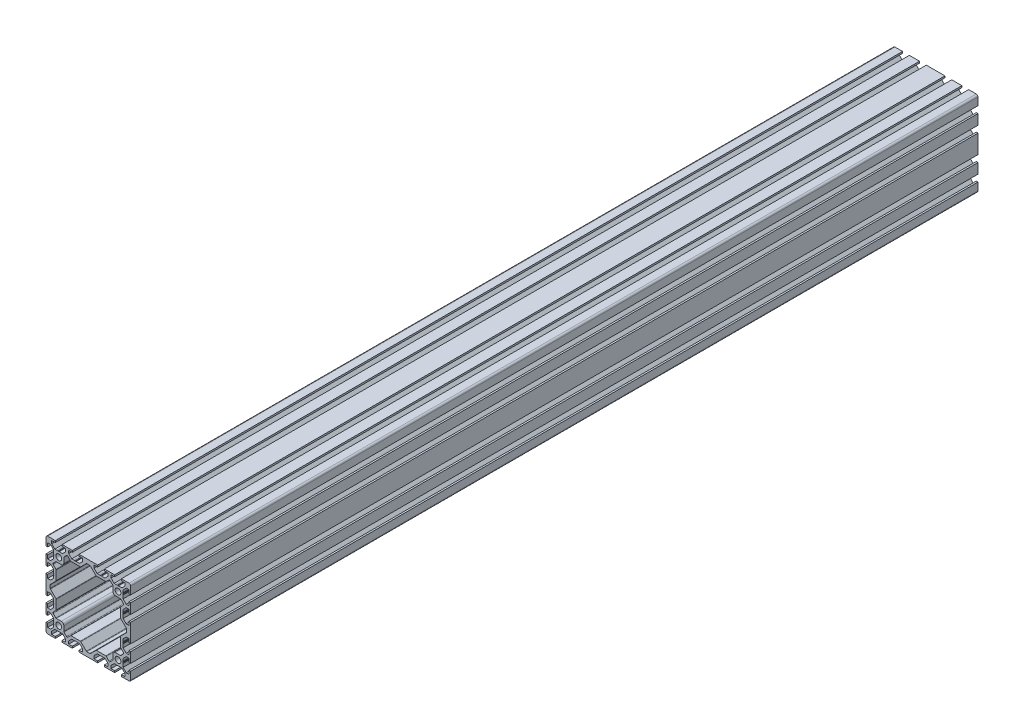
from build123d import *

# Parameters (mm, degrees)
MODEL_R            = 3.4
BOSS_EXTRU_1_DEPTH = 1000


with BuildPart() as part:
    # Model → Boss.-Extru.1 (new body)
    with BuildSketch(Plane.XY):
        with BuildLine():
            Line((-50, 11), (-50, -11))
            Line((-50, -11), (-48, -11))
            Line((-48, -11), (-48, -6.75))
            Line((-48, -6.75), (-44.664213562, -6.75))
            Line((-44.664213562, -6.75), (-41, -10.414213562))
            Line((-41, -10.414213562), (-41, -14.346410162))
            ThreePointArc((-41, -14.346410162), (-40.982962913, -14.475819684), (-40.933012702, -14.596410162))
            Line((-40.933012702, -14.596410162), (-40.7, -15))
            Line((-40.7, -15), (-40.933012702, -15.403589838))
            ThreePointArc((-40.933012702, -15.403589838), (-41, -15.653589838), (-40.933012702, -15.903589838))
            Line((-40.933012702, -15.903589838), (-40.750976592, -16.218885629))
            Line((-40.750976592, -16.218885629), (-41, -17.5))
            Line((-41, -17.5), (-41, -19.585786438))
            Line((-41, -19.585786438), (-44.664213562, -23.25))
            Line((-44.664213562, -23.25), (-48, -23.25))
            Line((-48, -23.25), (-48, -19))
            Line((-48, -19), (-50, -19))
            Line((-50, -19), (-50, -31))
            Line((-50, -31), (-48, -31))
            Line((-48, -31), (-48, -26.75))
            Line((-48, -26.75), (-44.664213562, -26.75))
            Line((-44.664213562, -26.75), (-41, -30.414213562))
            Line((-41, -30.414213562), (-41, -34.346410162))
            ThreePointArc((-41, -34.346410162), (-40.982962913, -34.475819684), (-40.933012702, -34.596410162))
            Line((-40.933012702, -34.596410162), (-40.7, -35))
            Line((-40.7, -35), (-40.933012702, -35.403589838))
            ThreePointArc((-40.933012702, -35.403589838), (-41, -35.653589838), (-40.933012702, -35.903589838))
            Line((-40.933012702, -35.903589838), (-40.750976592, -36.218885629))
            Line((-40.750976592, -36.218885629), (-41, -37.5))
            Line((-41, -37.5), (-41, -39.585786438))
            Line((-41, -39.585786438), (-44.664213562, -43.25))
            Line((-44.664213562, -43.25), (-48, -43.25))
            Line((-48, -43.25), (-48, -39))
            Line((-48, -39), (-50, -39))
            Line((-50, -39), (-50, -48))
            ThreePointArc((-50, -48), (-49.414213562, -49.414213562), (-48, -50))
            Line((-48, -50), (-39, -50))
            Line((-39, -50), (-39, -48))
            Line((-39, -48), (-43.25, -48))
            Line((-43.25, -48), (-43.25, -44.664213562))
            Line((-43.25, -44.664213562), (-39.585786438, -41))
            Line((-39.585786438, -41), (-35.653589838, -41))
            ThreePointArc((-35.653589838, -41), (-35.524180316, -40.982962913), (-35.403589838, -40.933012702))
            Line((-35.403589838, -40.933012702), (-35, -40.7))
            Line((-35, -40.7), (-34.596410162, -40.933012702))
            ThreePointArc((-34.596410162, -40.933012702), (-34.346410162, -41), (-34.096410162, -40.933012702))
            Line((-34.096410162, -40.933012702), (-33.781114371, -40.750976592))
            Line((-33.781114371, -40.750976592), (-32.5, -41))
            Line((-32.5, -41), (-30.414213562, -41))
            Line((-30.414213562, -41), (-26.75, -44.664213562))
            Line((-26.75, -44.664213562), (-26.75, -48))
            Line((-26.75, -48), (-31, -48))
            Line((-31, -48), (-31, -50))
            Line((-31, -50), (-19, -50))
            Line((-19, -50), (-19, -48))
            Line((-19, -48), (-23.25, -48))
            Line((-23.25, -48), (-23.25, -44.664213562))
            Line((-23.25, -44.664213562), (-19.585786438, -41))
            Line((-19.585786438, -41), (-15.653589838, -41))
            ThreePointArc((-15.653589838, -41), (-15.524180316, -40.982962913), (-15.403589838, -40.933012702))
            Line((-15.403589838, -40.933012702), (-15, -40.7))
            Line((-15, -40.7), (-14.596410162, -40.933012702))
            ThreePointArc((-14.596410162, -40.933012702), (-14.346410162, -41), (-14.096410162, -40.933012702))
            Line((-14.096410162, -40.933012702), (-13.781114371, -40.750976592))
            Line((-13.781114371, -40.750976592), (-12.5, -41))
            Line((-12.5, -41), (-10.414213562, -41))
            Line((-10.414213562, -41), (-6.75, -44.664213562))
            Line((-6.75, -44.664213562), (-6.75, -48))
            Line((-6.75, -48), (-11, -48))
            Line((-11, -48), (-11, -50))
            Line((-11, -50), (11, -50))
            Line((11, -50), (11, -48))
            Line((11, -48), (6.75, -48))
            Line((6.75, -48), (6.75, -44.664213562))
            Line((6.75, -44.664213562), (10.414213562, -41))
            Line((10.414213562, -41), (14.346410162, -41))
            ThreePointArc((14.346410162, -41), (14.475819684, -40.982962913), (14.596410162, -40.933012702))
            Line((14.596410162, -40.933012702), (15, -40.7))
            Line((15, -40.7), (15.403589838, -40.933012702))
            ThreePointArc((15.403589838, -40.933012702), (15.653589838, -41), (15.903589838, -40.933012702))
            Line((15.903589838, -40.933012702), (16.218885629, -40.750976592))
            Line((16.218885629, -40.750976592), (17.5, -41))
            Line((17.5, -41), (19.585786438, -41))
            Line((19.585786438, -41), (23.25, -44.664213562))
            Line((23.25, -44.664213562), (23.25, -48))
            Line((23.25, -48), (19, -48))
            Line((19, -48), (19, -50))
            Line((19, -50), (31, -50))
            Line((31, -50), (31, -48))
            Line((31, -48), (26.75, -48))
            Line((26.75, -48), (26.75, -44.664213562))
            Line((26.75, -44.664213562), (30.414213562, -41))
            Line((30.414213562, -41), (34.346410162, -41))
            ThreePointArc((34.346410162, -41), (34.475819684, -40.982962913), (34.596410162, -40.933012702))
            Line((34.596410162, -40.933012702), (35, -40.7))
            Line((35, -40.7), (35.403589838, -40.933012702))
            ThreePointArc((35.403589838, -40.933012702), (35.653589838, -41), (35.903589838, -40.933012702))
            Line((35.903589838, -40.933012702), (36.218885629, -40.750976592))
            Line((36.218885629, -40.750976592), (37.5, -41))
            Line((37.5, -41), (39.585786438, -41))
            Line((39.585786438, -41), (43.25, -44.664213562))
            Line((43.25, -44.664213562), (43.25, -48))
            Line((43.25, -48), (39, -48))
            Line((39, -48), (39, -50))
            Line((39, -50), (48, -50))
            ThreePointArc((48, -50), (49.414213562, -49.414213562), (50, -48))
            Line((50, -48), (50, -39))
            Line((50, -39), (48, -39))
            Line((48, -39), (48, -43.25))
            Line((48, -43.25), (44.664213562, -43.25))
            Line((44.664213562, -43.25), (41, -39.585786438))
            Line((41, -39.585786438), (41, -35.653589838))
            ThreePointArc((41, -35.653589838), (40.982962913, -35.524180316), (40.933012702, -35.403589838))
            Line((40.933012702, -35.403589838), (40.7, -35))
            Line((40.7, -35), (40.933012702, -34.596410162))
            ThreePointArc((40.933012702, -34.596410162), (41, -34.346410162), (40.933012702, -34.096410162))
            Line((40.933012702, -34.096410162), (40.750976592, -33.781114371))
            Line((40.750976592, -33.781114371), (41, -32.5))
            Line((41, -32.5), (41, -30.414213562))
            Line((41, -30.414213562), (44.664213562, -26.75))
            Line((44.664213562, -26.75), (48, -26.75))
            Line((48, -26.75), (48, -31))
            Line((48, -31), (50, -31))
            Line((50, -31), (50, -19))
            Line((50, -19), (48, -19))
            Line((48, -19), (48, -23.25))
            Line((48, -23.25), (44.664213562, -23.25))
            Line((44.664213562, -23.25), (41, -19.585786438))
            Line((41, -19.585786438), (41, -15.653589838))
            ThreePointArc((41, -15.653589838), (40.982962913, -15.524180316), (40.933012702, -15.403589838))
            Line((40.933012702, -15.403589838), (40.7, -15))
            Line((40.7, -15), (40.933012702, -14.596410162))
            ThreePointArc((40.933012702, -14.596410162), (41, -14.346410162), (40.933012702, -14.096410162))
            Line((40.933012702, -14.096410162), (40.750976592, -13.781114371))
            Line((40.750976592, -13.781114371), (41, -12.5))
            Line((41, -12.5), (41, -10.414213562))
            Line((41, -10.414213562), (44.664213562, -6.75))
            Line((44.664213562, -6.75), (48, -6.75))
            Line((48, -6.75), (48, -11))
            Line((48, -11), (50, -11))
            Line((50, -11), (50, 11))
            Line((50, 11), (48, 11))
            Line((48, 11), (48, 6.75))
            Line((48, 6.75), (44.664213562, 6.75))
            Line((44.664213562, 6.75), (41, 10.414213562))
            Line((41, 10.414213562), (41, 14.346410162))
            ThreePointArc((41, 14.346410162), (40.982962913, 14.475819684), (40.933012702, 14.596410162))
            Line((40.933012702, 14.596410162), (40.7, 15))
            Line((40.7, 15), (40.933012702, 15.403589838))
            ThreePointArc((40.933012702, 15.403589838), (41, 15.653589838), (40.933012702, 15.903589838))
            Line((40.933012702, 15.903589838), (40.750976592, 16.218885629))
            Line((40.750976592, 16.218885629), (41, 17.5))
            Line((41, 17.5), (41, 19.585786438))
            Line((41, 19.585786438), (44.664213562, 23.25))
            Line((44.664213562, 23.25), (48, 23.25))
            Line((48, 23.25), (48, 19))
            Line((48, 19), (50, 19))
            Line((50, 19), (50, 31))
            Line((50, 31), (48, 31))
            Line((48, 31), (48, 26.75))
            Line((48, 26.75), (44.664213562, 26.75))
            Line((44.664213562, 26.75), (41, 30.414213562))
            Line((41, 30.414213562), (41, 34.346410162))
            ThreePointArc((41, 34.346410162), (40.982962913, 34.475819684), (40.933012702, 34.596410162))
            Line((40.933012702, 34.596410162), (40.7, 35))
            Line((40.7, 35), (40.933012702, 35.403589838))
            ThreePointArc((40.933012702, 35.403589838), (41, 35.653589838), (40.933012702, 35.903589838))
            Line((40.933012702, 35.903589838), (40.750976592, 36.218885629))
            Line((40.750976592, 36.218885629), (41, 37.5))
            Line((41, 37.5), (41, 39.585786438))
            Line((41, 39.585786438), (44.664213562, 43.25))
            Line((44.664213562, 43.25), (48, 43.25))
            Line((48, 43.25), (48, 39))
            Line((48, 39), (50, 39))
            Line((50, 39), (50, 48))
            ThreePointArc((50, 48), (49.414213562, 49.414213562), (48, 50))
            Line((48, 50), (39, 50))
            Line((39, 50), (39, 48))
            Line((39, 48), (43.25, 48))
            Line((43.25, 48), (43.25, 44.664213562))
            Line((43.25, 44.664213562), (39.585786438, 41))
            Line((39.585786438, 41), (35.653589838, 41))
            ThreePointArc((35.653589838, 41), (35.524180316, 40.982962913), (35.403589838, 40.933012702))
            Line((35.403589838, 40.933012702), (35, 40.7))
            Line((35, 40.7), (34.596410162, 40.933012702))
            ThreePointArc((34.596410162, 40.933012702), (34.346410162, 41), (34.096410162, 40.933012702))
            Line((34.096410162, 40.933012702), (33.781114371, 40.750976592))
            Line((33.781114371, 40.750976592), (32.5, 41))
            Line((32.5, 41), (30.414213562, 41))
            Line((30.414213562, 41), (26.75, 44.664213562))
            Line((26.75, 44.664213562), (26.75, 48))
            Line((26.75, 48), (31, 48))
            Line((31, 48), (31, 50))
            Line((31, 50), (19, 50))
            Line((19, 50), (19, 48))
            Line((19, 48), (23.25, 48))
            Line((23.25, 48), (23.25, 44.664213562))
            Line((23.25, 44.664213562), (19.585786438, 41))
            Line((19.585786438, 41), (15.653589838, 41))
            ThreePointArc((15.653589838, 41), (15.524180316, 40.982962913), (15.403589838, 40.933012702))
            Line((15.403589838, 40.933012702), (15, 40.7))
            Line((15, 40.7), (14.596410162, 40.933012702))
            ThreePointArc((14.596410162, 40.933012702), (14.346410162, 41), (14.096410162, 40.933012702))
            Line((14.096410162, 40.933012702), (13.781114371, 40.750976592))
            Line((13.781114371, 40.750976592), (12.5, 41))
            Line((12.5, 41), (10.414213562, 41))
            Line((10.414213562, 41), (6.75, 44.664213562))
            Line((6.75, 44.664213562), (6.75, 48))
            Line((6.75, 48), (11, 48))
            Line((11, 48), (11, 50))
            Line((11, 50), (-11, 50))
            Line((-11, 50), (-11, 48))
            Line((-11, 48), (-6.75, 48))
            Line((-6.75, 48), (-6.75, 44.664213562))
            Line((-6.75, 44.664213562), (-10.414213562, 41))
            Line((-10.414213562, 41), (-14.346410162, 41))
            ThreePointArc((-14.346410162, 41), (-14.475819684, 40.982962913), (-14.596410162, 40.933012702))
            Line((-14.596410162, 40.933012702), (-15, 40.7))
            Line((-15, 40.7), (-15.403589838, 40.933012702))
            ThreePointArc((-15.403589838, 40.933012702), (-15.653589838, 41), (-15.903589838, 40.933012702))
            Line((-15.903589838, 40.933012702), (-16.218885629, 40.750976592))
            Line((-16.218885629, 40.750976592), (-17.5, 41))
            Line((-17.5, 41), (-19.585786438, 41))
            Line((-19.585786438, 41), (-23.25, 44.664213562))
            Line((-23.25, 44.664213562), (-23.25, 48))
            Line((-23.25, 48), (-19, 48))
            Line((-19, 48), (-19, 50))
            Line((-19, 50), (-31, 50))
            Line((-31, 50), (-31, 48))
            Line((-31, 48), (-26.75, 48))
            Line((-26.75, 48), (-26.75, 44.664213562))
            Line((-26.75, 44.664213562), (-30.414213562, 41))
            Line((-30.414213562, 41), (-34.346410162, 41))
            ThreePointArc((-34.346410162, 41), (-34.475819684, 40.982962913), (-34.596410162, 40.933012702))
            Line((-34.596410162, 40.933012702), (-35, 40.7))
            Line((-35, 40.7), (-35.403589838, 40.933012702))
            ThreePointArc((-35.403589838, 40.933012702), (-35.653589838, 41), (-35.903589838, 40.933012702))
            Line((-35.903589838, 40.933012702), (-36.218885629, 40.750976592))
            Line((-36.218885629, 40.750976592), (-37.5, 41))
            Line((-37.5, 41), (-39.585786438, 41))
            Line((-39.585786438, 41), (-43.25, 44.664213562))
            Line((-43.25, 44.664213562), (-43.25, 48))
            Line((-43.25, 48), (-39, 48))
            Line((-39, 48), (-39, 50))
            Line((-39, 50), (-48, 50))
            ThreePointArc((-48, 50), (-49.414213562, 49.414213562), (-50, 48))
            Line((-50, 48), (-50, 39))
            Line((-50, 39), (-48, 39))
            Line((-48, 39), (-48, 43.25))
            Line((-48, 43.25), (-44.664213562, 43.25))
            Line((-44.664213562, 43.25), (-41, 39.585786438))
            Line((-41, 39.585786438), (-41, 35.653589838))
            ThreePointArc((-41, 35.653589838), (-40.982962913, 35.524180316), (-40.933012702, 35.403589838))
            Line((-40.933012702, 35.403589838), (-40.7, 35))
            Line((-40.7, 35), (-40.933012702, 34.596410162))
            ThreePointArc((-40.933012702, 34.596410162), (-41, 34.346410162), (-40.933012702, 34.096410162))
            Line((-40.933012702, 34.096410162), (-40.750976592, 33.781114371))
            Line((-40.750976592, 33.781114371), (-41, 32.5))
            Line((-41, 32.5), (-41, 30.414213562))
            Line((-41, 30.414213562), (-44.664213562, 26.75))
            Line((-44.664213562, 26.75), (-48, 26.75))
            Line((-48, 26.75), (-48, 31))
            Line((-48, 31), (-50, 31))
            Line((-50, 31), (-50, 19))
            Line((-50, 19), (-48, 19))
            Line((-48, 19), (-48, 23.25))
            Line((-48, 23.25), (-44.664213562, 23.25))
            Line((-44.664213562, 23.25), (-41, 19.585786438))
            Line((-41, 19.585786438), (-41, 15.653589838))
            ThreePointArc((-41, 15.653589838), (-40.982962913, 15.524180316), (-40.933012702, 15.403589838))
            Line((-40.933012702, 15.403589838), (-40.7, 15))
            Line((-40.7, 15), (-40.933012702, 14.596410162))
            ThreePointArc((-40.933012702, 14.596410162), (-41, 14.346410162), (-40.933012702, 14.096410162))
            Line((-40.933012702, 14.096410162), (-40.750976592, 13.781114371))
            Line((-40.750976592, 13.781114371), (-41, 12.5))
            Line((-41, 12.5), (-41, 10.414213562))
            Line((-41, 10.414213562), (-44.664213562, 6.75))
            Line((-44.664213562, 6.75), (-48, 6.75))
            Line((-48, 6.75), (-48, 11))
            Line((-48, 11), (-50, 11))
        make_face()
        with Locations((35, -35)):
            Circle(MODEL_R, mode=Mode.SUBTRACT)
        with Locations((35, 35)):
            Circle(MODEL_R, mode=Mode.SUBTRACT)
        with Locations((-35, 35)):
            Circle(MODEL_R, mode=Mode.SUBTRACT)
        with Locations((-35, -35)):
            Circle(MODEL_R, mode=Mode.SUBTRACT)
        with BuildLine():
            Line((-45, 1.757359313), (-45, -1.757359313))
            ThreePointArc((-45, -1.757359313), (-44.923879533, -2.140042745), (-44.707106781, -2.464466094))
            Line((-44.707106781, -2.464466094), (-38.292893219, -8.878679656))
            ThreePointArc((-38.292893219, -8.878679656), (-38.076120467, -9.203103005), (-38, -9.585786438))
            Line((-38, -9.585786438), (-38, -20.414213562))
            ThreePointArc((-38, -20.414213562), (-38.076120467, -20.796896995), (-38.292893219, -21.121320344))
            Line((-38.292893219, -21.121320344), (-41.464466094, -24.292893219))
            ThreePointArc((-41.464466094, -24.292893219), (-41.757359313, -25), (-41.464466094, -25.707106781))
            Line((-41.464466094, -25.707106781), (-38.464466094, -28.707106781))
            ThreePointArc((-38.464466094, -28.707106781), (-38.140042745, -28.923879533), (-37.757359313, -29))
            Line((-37.757359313, -29), (-32, -29))
            ThreePointArc((-32, -29), (-29.878679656, -29.878679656), (-29, -32))
            Line((-29, -32), (-29, -37.757359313))
            ThreePointArc((-29, -37.757359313), (-28.923879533, -38.140042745), (-28.707106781, -38.464466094))
            Line((-28.707106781, -38.464466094), (-25.707106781, -41.464466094))
            ThreePointArc((-25.707106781, -41.464466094), (-25, -41.757359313), (-24.292893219, -41.464466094))
            Line((-24.292893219, -41.464466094), (-21.121320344, -38.292893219))
            ThreePointArc((-21.121320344, -38.292893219), (-20.796896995, -38.076120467), (-20.414213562, -38))
            Line((-20.414213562, -38), (-9.585786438, -38))
            ThreePointArc((-9.585786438, -38), (-9.203103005, -38.076120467), (-8.878679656, -38.292893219))
            Line((-8.878679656, -38.292893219), (-2.464466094, -44.707106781))
            ThreePointArc((-2.464466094, -44.707106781), (-2.140042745, -44.923879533), (-1.757359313, -45))
            Line((-1.757359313, -45), (1.757359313, -45))
            ThreePointArc((1.757359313, -45), (2.140042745, -44.923879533), (2.464466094, -44.707106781))
            Line((2.464466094, -44.707106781), (8.878679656, -38.292893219))
            ThreePointArc((8.878679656, -38.292893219), (9.203103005, -38.076120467), (9.585786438, -38))
            Line((9.585786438, -38), (20.414213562, -38))
            ThreePointArc((20.414213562, -38), (20.796896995, -38.076120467), (21.121320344, -38.292893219))
            Line((21.121320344, -38.292893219), (24.292893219, -41.464466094))
            ThreePointArc((24.292893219, -41.464466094), (25, -41.757359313), (25.707106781, -41.464466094))
            Line((25.707106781, -41.464466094), (28.707106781, -38.464466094))
            ThreePointArc((28.707106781, -38.464466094), (28.923879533, -38.140042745), (29, -37.757359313))
            Line((29, -37.757359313), (29, -32))
            ThreePointArc((29, -32), (29.878679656, -29.878679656), (32, -29))
            Line((32, -29), (37.757359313, -29))
            ThreePointArc((37.757359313, -29), (38.140042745, -28.923879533), (38.464466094, -28.707106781))
            Line((38.464466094, -28.707106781), (41.464466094, -25.707106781))
            ThreePointArc((41.464466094, -25.707106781), (41.757359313, -25), (41.464466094, -24.292893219))
            Line((41.464466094, -24.292893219), (38.292893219, -21.121320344))
            ThreePointArc((38.292893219, -21.121320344), (38.076120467, -20.796896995), (38, -20.414213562))
            Line((38, -20.414213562), (38, -9.585786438))
            ThreePointArc((38, -9.585786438), (38.076120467, -9.203103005), (38.292893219, -8.878679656))
            Line((38.292893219, -8.878679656), (44.707106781, -2.464466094))
            ThreePointArc((44.707106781, -2.464466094), (44.923879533, -2.140042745), (45, -1.757359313))
            Line((45, -1.757359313), (45, 1.757359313))
            ThreePointArc((45, 1.757359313), (44.923879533, 2.140042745), (44.707106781, 2.464466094))
            Line((44.707106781, 2.464466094), (38.292893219, 8.878679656))
            ThreePointArc((38.292893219, 8.878679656), (38.076120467, 9.203103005), (38, 9.585786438))
            Line((38, 9.585786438), (38, 20.414213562))
            ThreePointArc((38, 20.414213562), (38.076120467, 20.796896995), (38.292893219, 21.121320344))
            Line((38.292893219, 21.121320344), (41.464466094, 24.292893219))
            ThreePointArc((41.464466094, 24.292893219), (41.757359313, 25), (41.464466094, 25.707106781))
            Line((41.464466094, 25.707106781), (38.464466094, 28.707106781))
            ThreePointArc((38.464466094, 28.707106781), (38.140042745, 28.923879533), (37.757359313, 29))
            Line((37.757359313, 29), (32, 29))
            ThreePointArc((32, 29), (29.878679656, 29.878679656), (29, 32))
            Line((29, 32), (29, 37.757359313))
            ThreePointArc((29, 37.757359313), (28.923879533, 38.140042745), (28.707106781, 38.464466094))
            Line((28.707106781, 38.464466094), (25.707106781, 41.464466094))
            ThreePointArc((25.707106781, 41.464466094), (25, 41.757359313), (24.292893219, 41.464466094))
            Line((24.292893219, 41.464466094), (21.121320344, 38.292893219))
            ThreePointArc((21.121320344, 38.292893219), (20.796896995, 38.076120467), (20.414213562, 38))
            Line((20.414213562, 38), (9.585786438, 38))
            ThreePointArc((9.585786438, 38), (9.203103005, 38.076120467), (8.878679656, 38.292893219))
            Line((8.878679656, 38.292893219), (2.464466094, 44.707106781))
            ThreePointArc((2.464466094, 44.707106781), (2.140042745, 44.923879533), (1.757359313, 45))
            Line((1.757359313, 45), (-1.757359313, 45))
            ThreePointArc((-1.757359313, 45), (-2.140042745, 44.923879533), (-2.464466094, 44.707106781))
            Line((-2.464466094, 44.707106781), (-8.878679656, 38.292893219))
            ThreePointArc((-8.878679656, 38.292893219), (-9.203103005, 38.076120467), (-9.585786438, 38))
            Line((-9.585786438, 38), (-20.414213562, 38))
            ThreePointArc((-20.414213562, 38), (-20.796896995, 38.076120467), (-21.121320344, 38.292893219))
            Line((-21.121320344, 38.292893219), (-24.292893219, 41.464466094))
            ThreePointArc((-24.292893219, 41.464466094), (-25, 41.757359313), (-25.707106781, 41.464466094))
            Line((-25.707106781, 41.464466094), (-28.707106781, 38.464466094))
            ThreePointArc((-28.707106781, 38.464466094), (-28.923879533, 38.140042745), (-29, 37.757359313))
            Line((-29, 37.757359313), (-29, 32))
            ThreePointArc((-29, 32), (-29.878679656, 29.878679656), (-32, 29))
            Line((-32, 29), (-37.757359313, 29))
            ThreePointArc((-37.757359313, 29), (-38.140042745, 28.923879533), (-38.464466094, 28.707106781))
            Line((-38.464466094, 28.707106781), (-41.464466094, 25.707106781))
            ThreePointArc((-41.464466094, 25.707106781), (-41.757359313, 25), (-41.464466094, 24.292893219))
            Line((-41.464466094, 24.292893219), (-38.292893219, 21.121320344))
            ThreePointArc((-38.292893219, 21.121320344), (-38.076120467, 20.796896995), (-38, 20.414213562))
            Line((-38, 20.414213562), (-38, 9.585786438))
            ThreePointArc((-38, 9.585786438), (-38.076120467, 9.203103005), (-38.292893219, 8.878679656))
            Line((-38.292893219, 8.878679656), (-44.707106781, 2.464466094))
            ThreePointArc((-44.707106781, 2.464466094), (-44.923879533, 2.140042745), (-45, 1.757359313))
        make_face(mode=Mode.SUBTRACT)
    extrude(amount=BOSS_EXTRU_1_DEPTH)


solid = part.part
